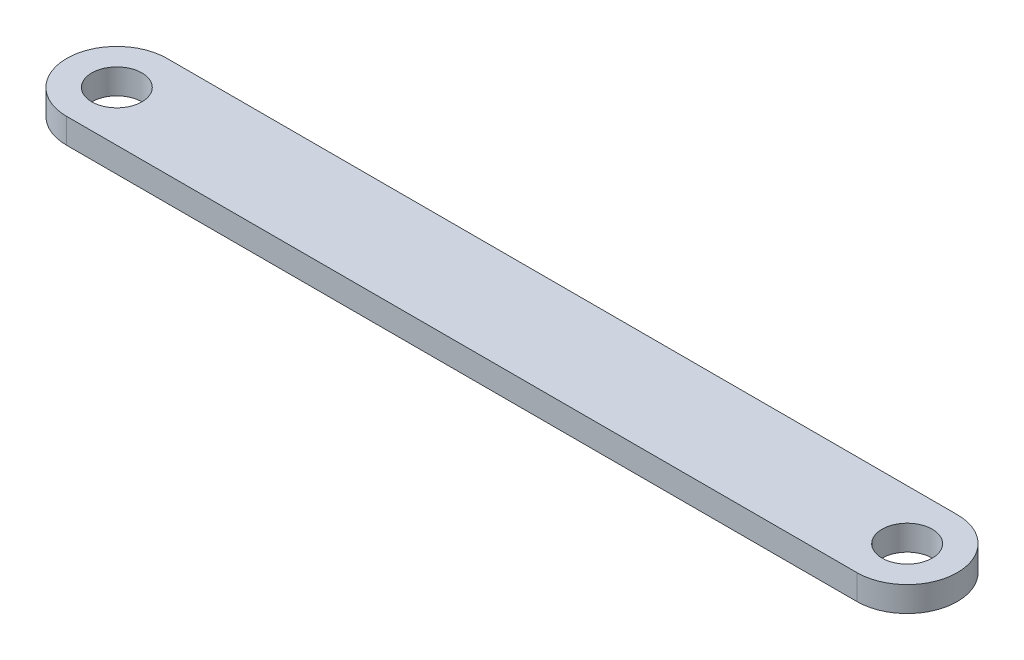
ISO-10303-21;
HEADER;
FILE_DESCRIPTION(('STEP AP214'),'2;1');
FILE_NAME('part.step','',(''),(''),'','','');
FILE_SCHEMA(('AUTOMOTIVE_DESIGN { 1 0 10303 214 1 1 1 1 }'));
ENDSEC;
DATA;
#1=APPLICATION_CONTEXT('core data for automotive mechanical design processes');
#2=APPLICATION_PROTOCOL_DEFINITION('international standard','automotive_design',2000,#1);
#3=PRODUCT_CONTEXT('',#1,'mechanical');
#4=PRODUCT('Part','Part','',(#3));
#5=PRODUCT_RELATED_PRODUCT_CATEGORY('part','',(#4));
#6=PRODUCT_DEFINITION_FORMATION('','',#4);
#7=PRODUCT_DEFINITION_CONTEXT('part definition',#1,'design');
#8=PRODUCT_DEFINITION('design','',#6,#7);
#9=PRODUCT_DEFINITION_SHAPE('','',#8);
#10=(LENGTH_UNIT() NAMED_UNIT(*) SI_UNIT(.MILLI.,.METRE.));
#11=(NAMED_UNIT(*) PLANE_ANGLE_UNIT() SI_UNIT($,.RADIAN.));
#12=(NAMED_UNIT(*) SI_UNIT($,.STERADIAN.) SOLID_ANGLE_UNIT());
#13=UNCERTAINTY_MEASURE_WITH_UNIT(LENGTH_MEASURE(1.E-05),#10,'distance_accuracy_value','');
#14=(GEOMETRIC_REPRESENTATION_CONTEXT(3) GLOBAL_UNCERTAINTY_ASSIGNED_CONTEXT((#13)) GLOBAL_UNIT_ASSIGNED_CONTEXT((#10,
#11,#12)) REPRESENTATION_CONTEXT('',''));
#15=CARTESIAN_POINT('',(0.,0.,0.));
#16=DIRECTION('',(0.,0.,1.));
#17=DIRECTION('',(1.,0.,0.));
#18=AXIS2_PLACEMENT_3D('',#15,#16,#17);
#19=CARTESIAN_POINT('',(0.,3.175,0.));
#20=DIRECTION('',(0.,1.,0.));
#21=DIRECTION('',(0.,0.,1.));
#22=AXIS2_PLACEMENT_3D('',#19,#20,#21);
#23=PLANE('',#22);
#24=CARTESIAN_POINT('',(0.,3.175,0.));
#25=DIRECTION('',(0.,1.,0.));
#26=DIRECTION('',(0.,0.,1.));
#27=AXIS2_PLACEMENT_3D('',#24,#25,#26);
#28=CIRCLE('',#27,3.175);
#29=CARTESIAN_POINT('',(0.,3.175,3.175));
#30=VERTEX_POINT('',#29);
#31=EDGE_CURVE('E116',#30,#30,#28,.T.);
#32=ORIENTED_EDGE('',*,*,#31,.F.);
#33=EDGE_LOOP('',(#32));
#34=FACE_BOUND('',#33,.T.);
#35=CARTESIAN_POINT('',(0.,3.175,0.));
#36=DIRECTION('',(0.,1.,0.));
#37=DIRECTION('',(0.,0.,1.));
#38=AXIS2_PLACEMENT_3D('',#35,#36,#37);
#39=CIRCLE('',#38,6.35);
#40=CARTESIAN_POINT('',(0.,3.175,-6.35));
#41=VERTEX_POINT('',#40);
#42=CARTESIAN_POINT('',(0.,3.175,6.35));
#43=VERTEX_POINT('',#42);
#44=EDGE_CURVE('E101',#41,#43,#39,.T.);
#45=ORIENTED_EDGE('',*,*,#44,.T.);
#46=DIRECTION('',(1.,0.,0.));
#47=VECTOR('',#46,1.);
#48=CARTESIAN_POINT('',(0.,3.175,6.35));
#49=LINE('',#48,#47);
#50=CARTESIAN_POINT('',(100.,3.175,6.35));
#51=VERTEX_POINT('',#50);
#52=EDGE_CURVE('E96',#43,#51,#49,.T.);
#53=ORIENTED_EDGE('',*,*,#52,.T.);
#54=CARTESIAN_POINT('',(100.,3.175,0.));
#55=DIRECTION('',(0.,1.,0.));
#56=DIRECTION('',(0.,0.,1.));
#57=AXIS2_PLACEMENT_3D('',#54,#55,#56);
#58=CIRCLE('',#57,6.35);
#59=CARTESIAN_POINT('',(100.,3.175,-6.35));
#60=VERTEX_POINT('',#59);
#61=EDGE_CURVE('E99',#51,#60,#58,.T.);
#62=ORIENTED_EDGE('',*,*,#61,.T.);
#63=DIRECTION('',(-1.,0.,0.));
#64=VECTOR('',#63,1.);
#65=CARTESIAN_POINT('',(0.,3.175,-6.35));
#66=LINE('',#65,#64);
#67=EDGE_CURVE('E66',#60,#41,#66,.T.);
#68=ORIENTED_EDGE('',*,*,#67,.T.);
#69=EDGE_LOOP('',(#45,#53,#62,#68));
#70=FACE_BOUND('',#69,.T.);
#71=CARTESIAN_POINT('',(100.,3.175,0.));
#72=DIRECTION('',(0.,1.,0.));
#73=DIRECTION('',(0.,0.,1.));
#74=AXIS2_PLACEMENT_3D('',#71,#72,#73);
#75=CIRCLE('',#74,3.175);
#76=CARTESIAN_POINT('',(100.,3.175,3.175));
#77=VERTEX_POINT('',#76);
#78=EDGE_CURVE('E131',#77,#77,#75,.T.);
#79=ORIENTED_EDGE('',*,*,#78,.F.);
#80=EDGE_LOOP('',(#79));
#81=FACE_BOUND('',#80,.T.);
#82=ADVANCED_FACE('F49',(#34,#70,#81),#23,.T.);
#83=CARTESIAN_POINT('',(0.,0.,0.));
#84=DIRECTION('',(0.,1.,0.));
#85=DIRECTION('',(0.,0.,1.));
#86=AXIS2_PLACEMENT_3D('',#83,#84,#85);
#87=PLANE('',#86);
#88=CARTESIAN_POINT('',(0.,0.,0.));
#89=DIRECTION('',(0.,1.,0.));
#90=DIRECTION('',(0.,0.,1.));
#91=AXIS2_PLACEMENT_3D('',#88,#89,#90);
#92=CIRCLE('',#91,6.35);
#93=CARTESIAN_POINT('',(0.,0.,-6.35));
#94=VERTEX_POINT('',#93);
#95=CARTESIAN_POINT('',(0.,0.,6.35));
#96=VERTEX_POINT('',#95);
#97=EDGE_CURVE('E113',#94,#96,#92,.T.);
#98=ORIENTED_EDGE('',*,*,#97,.F.);
#99=DIRECTION('',(-1.,0.,0.));
#100=VECTOR('',#99,1.);
#101=CARTESIAN_POINT('',(0.,0.,-6.35));
#102=LINE('',#101,#100);
#103=CARTESIAN_POINT('',(100.,0.,-6.35));
#104=VERTEX_POINT('',#103);
#105=EDGE_CURVE('E89',#104,#94,#102,.T.);
#106=ORIENTED_EDGE('',*,*,#105,.F.);
#107=CARTESIAN_POINT('',(100.,0.,0.));
#108=DIRECTION('',(0.,1.,0.));
#109=DIRECTION('',(0.,0.,1.));
#110=AXIS2_PLACEMENT_3D('',#107,#108,#109);
#111=CIRCLE('',#110,6.35);
#112=CARTESIAN_POINT('',(100.,0.,6.35));
#113=VERTEX_POINT('',#112);
#114=EDGE_CURVE('E83',#113,#104,#111,.T.);
#115=ORIENTED_EDGE('',*,*,#114,.F.);
#116=DIRECTION('',(1.,0.,0.));
#117=VECTOR('',#116,1.);
#118=CARTESIAN_POINT('',(0.,0.,6.35));
#119=LINE('',#118,#117);
#120=EDGE_CURVE('E105',#96,#113,#119,.T.);
#121=ORIENTED_EDGE('',*,*,#120,.F.);
#122=EDGE_LOOP('',(#98,#106,#115,#121));
#123=FACE_BOUND('',#122,.T.);
#124=CARTESIAN_POINT('',(0.,0.,0.));
#125=DIRECTION('',(0.,1.,0.));
#126=DIRECTION('',(0.,0.,1.));
#127=AXIS2_PLACEMENT_3D('',#124,#125,#126);
#128=CIRCLE('',#127,3.175);
#129=CARTESIAN_POINT('',(0.,0.,3.175));
#130=VERTEX_POINT('',#129);
#131=EDGE_CURVE('E128',#130,#130,#128,.T.);
#132=ORIENTED_EDGE('',*,*,#131,.T.);
#133=EDGE_LOOP('',(#132));
#134=FACE_BOUND('',#133,.T.);
#135=CARTESIAN_POINT('',(100.,0.,0.));
#136=DIRECTION('',(0.,1.,0.));
#137=DIRECTION('',(0.,0.,1.));
#138=AXIS2_PLACEMENT_3D('',#135,#136,#137);
#139=CIRCLE('',#138,3.175);
#140=CARTESIAN_POINT('',(100.,0.,3.175));
#141=VERTEX_POINT('',#140);
#142=EDGE_CURVE('E134',#141,#141,#139,.T.);
#143=ORIENTED_EDGE('',*,*,#142,.T.);
#144=EDGE_LOOP('',(#143));
#145=FACE_BOUND('',#144,.T.);
#146=ADVANCED_FACE('F124',(#123,#134,#145),#87,.F.);
#147=CARTESIAN_POINT('',(0.,3.175,0.));
#148=DIRECTION('',(0.,-1.,0.));
#149=DIRECTION('',(0.,0.,-1.));
#150=AXIS2_PLACEMENT_3D('',#147,#148,#149);
#151=CYLINDRICAL_SURFACE('',#150,6.35);
#152=ORIENTED_EDGE('',*,*,#97,.T.);
#153=DIRECTION('',(0.,-1.,0.));
#154=VECTOR('',#153,1.);
#155=CARTESIAN_POINT('',(0.,3.175,6.35));
#156=LINE('',#155,#154);
#157=EDGE_CURVE('E11',#43,#96,#156,.T.);
#158=ORIENTED_EDGE('',*,*,#157,.F.);
#159=ORIENTED_EDGE('',*,*,#44,.F.);
#160=DIRECTION('',(0.,-1.,0.));
#161=VECTOR('',#160,1.);
#162=CARTESIAN_POINT('',(0.,3.175,-6.35));
#163=LINE('',#162,#161);
#164=EDGE_CURVE('E109',#41,#94,#163,.T.);
#165=ORIENTED_EDGE('',*,*,#164,.T.);
#166=EDGE_LOOP('',(#152,#158,#159,#165));
#167=FACE_BOUND('',#166,.T.);
#168=ADVANCED_FACE('F51',(#167),#151,.T.);
#169=CARTESIAN_POINT('',(0.,3.175,6.35));
#170=DIRECTION('',(0.,0.,-1.));
#171=DIRECTION('',(-1.,0.,0.));
#172=AXIS2_PLACEMENT_3D('',#169,#170,#171);
#173=PLANE('',#172);
#174=ORIENTED_EDGE('',*,*,#120,.T.);
#175=DIRECTION('',(0.,-1.,0.));
#176=VECTOR('',#175,1.);
#177=CARTESIAN_POINT('',(100.,3.175,6.35));
#178=LINE('',#177,#176);
#179=EDGE_CURVE('E58',#51,#113,#178,.T.);
#180=ORIENTED_EDGE('',*,*,#179,.F.);
#181=ORIENTED_EDGE('',*,*,#52,.F.);
#182=ORIENTED_EDGE('',*,*,#157,.T.);
#183=EDGE_LOOP('',(#174,#180,#181,#182));
#184=FACE_BOUND('',#183,.T.);
#185=ADVANCED_FACE('F104',(#184),#173,.F.);
#186=CARTESIAN_POINT('',(100.,3.175,0.));
#187=DIRECTION('',(0.,-1.,0.));
#188=DIRECTION('',(0.,0.,-1.));
#189=AXIS2_PLACEMENT_3D('',#186,#187,#188);
#190=CYLINDRICAL_SURFACE('',#189,6.35);
#191=ORIENTED_EDGE('',*,*,#114,.T.);
#192=DIRECTION('',(0.,-1.,0.));
#193=VECTOR('',#192,1.);
#194=CARTESIAN_POINT('',(100.,3.175,-6.35));
#195=LINE('',#194,#193);
#196=EDGE_CURVE('E106',#60,#104,#195,.T.);
#197=ORIENTED_EDGE('',*,*,#196,.F.);
#198=ORIENTED_EDGE('',*,*,#61,.F.);
#199=ORIENTED_EDGE('',*,*,#179,.T.);
#200=EDGE_LOOP('',(#191,#197,#198,#199));
#201=FACE_BOUND('',#200,.T.);
#202=ADVANCED_FACE('F107',(#201),#190,.T.);
#203=CARTESIAN_POINT('',(0.,3.175,-6.35));
#204=DIRECTION('',(0.,0.,1.));
#205=DIRECTION('',(1.,0.,0.));
#206=AXIS2_PLACEMENT_3D('',#203,#204,#205);
#207=PLANE('',#206);
#208=ORIENTED_EDGE('',*,*,#105,.T.);
#209=ORIENTED_EDGE('',*,*,#164,.F.);
#210=ORIENTED_EDGE('',*,*,#67,.F.);
#211=ORIENTED_EDGE('',*,*,#196,.T.);
#212=EDGE_LOOP('',(#208,#209,#210,#211));
#213=FACE_BOUND('',#212,.T.);
#214=ADVANCED_FACE('F121',(#213),#207,.F.);
#215=CARTESIAN_POINT('',(0.,3.175,0.));
#216=DIRECTION('',(0.,-1.,0.));
#217=DIRECTION('',(0.,0.,-1.));
#218=AXIS2_PLACEMENT_3D('',#215,#216,#217);
#219=CYLINDRICAL_SURFACE('',#218,3.175);
#220=ORIENTED_EDGE('',*,*,#31,.T.);
#221=EDGE_LOOP('',(#220));
#222=FACE_BOUND('',#221,.T.);
#223=ORIENTED_EDGE('',*,*,#131,.F.);
#224=EDGE_LOOP('',(#223));
#225=FACE_BOUND('',#224,.T.);
#226=ADVANCED_FACE('F151',(#222,#225),#219,.F.);
#227=CARTESIAN_POINT('',(100.,3.175,0.));
#228=DIRECTION('',(0.,-1.,0.));
#229=DIRECTION('',(0.,0.,-1.));
#230=AXIS2_PLACEMENT_3D('',#227,#228,#229);
#231=CYLINDRICAL_SURFACE('',#230,3.175);
#232=ORIENTED_EDGE('',*,*,#78,.T.);
#233=EDGE_LOOP('',(#232));
#234=FACE_BOUND('',#233,.T.);
#235=ORIENTED_EDGE('',*,*,#142,.F.);
#236=EDGE_LOOP('',(#235));
#237=FACE_BOUND('',#236,.T.);
#238=ADVANCED_FACE('F140',(#234,#237),#231,.F.);
#239=CLOSED_SHELL('',(#82,#146,#168,#185,#202,#214,#226,#238));
#240=MANIFOLD_SOLID_BREP('B2',#239);
#241=ADVANCED_BREP_SHAPE_REPRESENTATION('',(#18,#240),#14);
#242=SHAPE_DEFINITION_REPRESENTATION(#9,#241);
ENDSEC;
END-ISO-10303-21;
